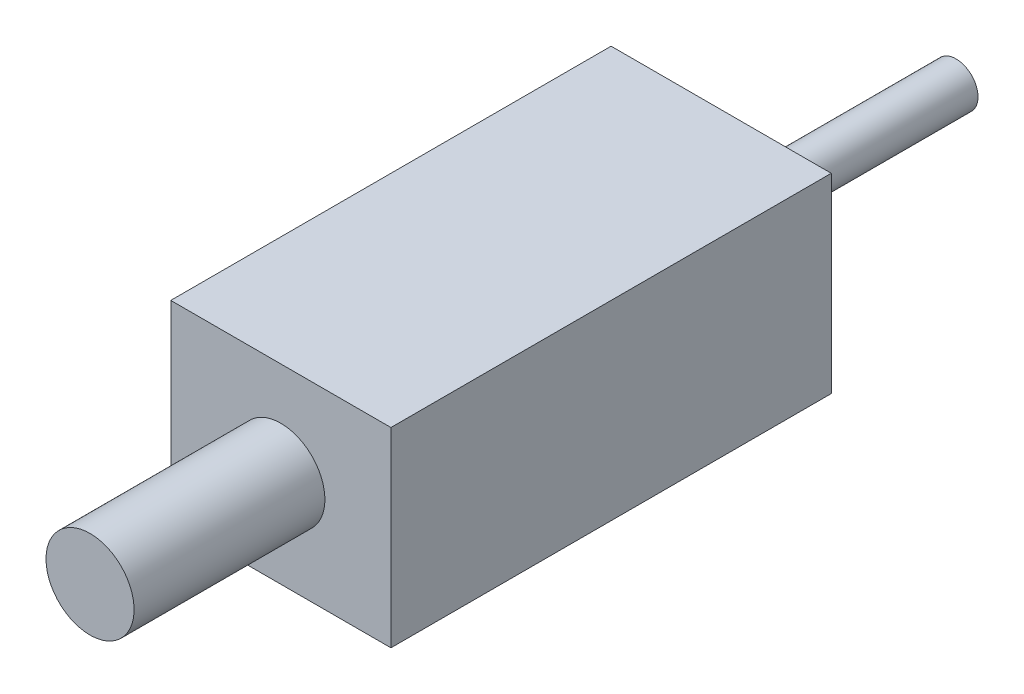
ISO-10303-21;
HEADER;
FILE_DESCRIPTION(('STEP AP214'),'2;1');
FILE_NAME('part.step','',(''),(''),'','','');
FILE_SCHEMA(('AUTOMOTIVE_DESIGN { 1 0 10303 214 1 1 1 1 }'));
ENDSEC;
DATA;
#1=APPLICATION_CONTEXT('core data for automotive mechanical design processes');
#2=APPLICATION_PROTOCOL_DEFINITION('international standard','automotive_design',2000,#1);
#3=PRODUCT_CONTEXT('',#1,'mechanical');
#4=PRODUCT('Part','Part','',(#3));
#5=PRODUCT_RELATED_PRODUCT_CATEGORY('part','',(#4));
#6=PRODUCT_DEFINITION_FORMATION('','',#4);
#7=PRODUCT_DEFINITION_CONTEXT('part definition',#1,'design');
#8=PRODUCT_DEFINITION('design','',#6,#7);
#9=PRODUCT_DEFINITION_SHAPE('','',#8);
#10=(LENGTH_UNIT() NAMED_UNIT(*) SI_UNIT(.MILLI.,.METRE.));
#11=(NAMED_UNIT(*) PLANE_ANGLE_UNIT() SI_UNIT($,.RADIAN.));
#12=(NAMED_UNIT(*) SI_UNIT($,.STERADIAN.) SOLID_ANGLE_UNIT());
#13=UNCERTAINTY_MEASURE_WITH_UNIT(LENGTH_MEASURE(1.E-05),#10,'distance_accuracy_value','');
#14=(GEOMETRIC_REPRESENTATION_CONTEXT(3) GLOBAL_UNCERTAINTY_ASSIGNED_CONTEXT((#13)) GLOBAL_UNIT_ASSIGNED_CONTEXT((#10,
#11,#12)) REPRESENTATION_CONTEXT('',''));
#15=CARTESIAN_POINT('',(0.,0.,0.));
#16=DIRECTION('',(0.,0.,1.));
#17=DIRECTION('',(1.,0.,0.));
#18=AXIS2_PLACEMENT_3D('',#15,#16,#17);
#19=CARTESIAN_POINT('',(7.5,6.5,30.));
#20=DIRECTION('',(-1.,0.,0.));
#21=DIRECTION('',(0.,-1.,0.));
#22=AXIS2_PLACEMENT_3D('',#19,#20,#21);
#23=PLANE('',#22);
#24=DIRECTION('',(0.,1.,0.));
#25=VECTOR('',#24,1.);
#26=CARTESIAN_POINT('',(7.5,6.5,0.));
#27=LINE('',#26,#25);
#28=CARTESIAN_POINT('',(7.5,-6.5,0.));
#29=VERTEX_POINT('',#28);
#30=CARTESIAN_POINT('',(7.5,6.5,0.));
#31=VERTEX_POINT('',#30);
#32=EDGE_CURVE('E108',#29,#31,#27,.T.);
#33=ORIENTED_EDGE('',*,*,#32,.T.);
#34=DIRECTION('',(0.,0.,-1.));
#35=VECTOR('',#34,1.);
#36=CARTESIAN_POINT('',(7.5,6.5,30.));
#37=LINE('',#36,#35);
#38=CARTESIAN_POINT('',(7.5,6.5,30.));
#39=VERTEX_POINT('',#38);
#40=EDGE_CURVE('E44',#39,#31,#37,.T.);
#41=ORIENTED_EDGE('',*,*,#40,.F.);
#42=DIRECTION('',(0.,1.,0.));
#43=VECTOR('',#42,1.);
#44=CARTESIAN_POINT('',(7.5,6.5,30.));
#45=LINE('',#44,#43);
#46=CARTESIAN_POINT('',(7.5,-6.5,30.));
#47=VERTEX_POINT('',#46);
#48=EDGE_CURVE('E95',#47,#39,#45,.T.);
#49=ORIENTED_EDGE('',*,*,#48,.F.);
#50=DIRECTION('',(0.,0.,-1.));
#51=VECTOR('',#50,1.);
#52=CARTESIAN_POINT('',(7.5,-6.5,30.));
#53=LINE('',#52,#51);
#54=EDGE_CURVE('E104',#47,#29,#53,.T.);
#55=ORIENTED_EDGE('',*,*,#54,.T.);
#56=EDGE_LOOP('',(#33,#41,#49,#55));
#57=FACE_BOUND('',#56,.T.);
#58=ADVANCED_FACE('F41',(#57),#23,.F.);
#59=CARTESIAN_POINT('',(-7.5,6.5,30.));
#60=DIRECTION('',(0.,-1.,0.));
#61=DIRECTION('',(0.,0.,-1.));
#62=AXIS2_PLACEMENT_3D('',#59,#60,#61);
#63=PLANE('',#62);
#64=DIRECTION('',(-1.,0.,0.));
#65=VECTOR('',#64,1.);
#66=CARTESIAN_POINT('',(-7.5,6.5,0.));
#67=LINE('',#66,#65);
#68=CARTESIAN_POINT('',(-7.5,6.5,0.));
#69=VERTEX_POINT('',#68);
#70=EDGE_CURVE('E100',#31,#69,#67,.T.);
#71=ORIENTED_EDGE('',*,*,#70,.T.);
#72=DIRECTION('',(0.,0.,-1.));
#73=VECTOR('',#72,1.);
#74=CARTESIAN_POINT('',(-7.5,6.5,30.));
#75=LINE('',#74,#73);
#76=CARTESIAN_POINT('',(-7.5,6.5,30.));
#77=VERTEX_POINT('',#76);
#78=EDGE_CURVE('E98',#77,#69,#75,.T.);
#79=ORIENTED_EDGE('',*,*,#78,.F.);
#80=DIRECTION('',(-1.,0.,0.));
#81=VECTOR('',#80,1.);
#82=CARTESIAN_POINT('',(-7.5,6.5,30.));
#83=LINE('',#82,#81);
#84=EDGE_CURVE('E90',#39,#77,#83,.T.);
#85=ORIENTED_EDGE('',*,*,#84,.F.);
#86=ORIENTED_EDGE('',*,*,#40,.T.);
#87=EDGE_LOOP('',(#71,#79,#85,#86));
#88=FACE_BOUND('',#87,.T.);
#89=ADVANCED_FACE('F99',(#88),#63,.F.);
#90=CARTESIAN_POINT('',(-7.5,6.5,30.));
#91=DIRECTION('',(1.,0.,0.));
#92=DIRECTION('',(0.,1.,0.));
#93=AXIS2_PLACEMENT_3D('',#90,#91,#92);
#94=PLANE('',#93);
#95=DIRECTION('',(0.,-1.,0.));
#96=VECTOR('',#95,1.);
#97=CARTESIAN_POINT('',(-7.5,6.5,0.));
#98=LINE('',#97,#96);
#99=CARTESIAN_POINT('',(-7.5,-6.5,0.));
#100=VERTEX_POINT('',#99);
#101=EDGE_CURVE('E76',#69,#100,#98,.T.);
#102=ORIENTED_EDGE('',*,*,#101,.T.);
#103=DIRECTION('',(0.,0.,-1.));
#104=VECTOR('',#103,1.);
#105=CARTESIAN_POINT('',(-7.5,-6.5,30.));
#106=LINE('',#105,#104);
#107=CARTESIAN_POINT('',(-7.5,-6.5,30.));
#108=VERTEX_POINT('',#107);
#109=EDGE_CURVE('E101',#108,#100,#106,.T.);
#110=ORIENTED_EDGE('',*,*,#109,.F.);
#111=DIRECTION('',(0.,-1.,0.));
#112=VECTOR('',#111,1.);
#113=CARTESIAN_POINT('',(-7.5,6.5,30.));
#114=LINE('',#113,#112);
#115=EDGE_CURVE('E93',#77,#108,#114,.T.);
#116=ORIENTED_EDGE('',*,*,#115,.F.);
#117=ORIENTED_EDGE('',*,*,#78,.T.);
#118=EDGE_LOOP('',(#102,#110,#116,#117));
#119=FACE_BOUND('',#118,.T.);
#120=ADVANCED_FACE('F102',(#119),#94,.F.);
#121=CARTESIAN_POINT('',(-7.5,-6.5,30.));
#122=DIRECTION('',(0.,1.,0.));
#123=DIRECTION('',(0.,0.,1.));
#124=AXIS2_PLACEMENT_3D('',#121,#122,#123);
#125=PLANE('',#124);
#126=DIRECTION('',(1.,0.,0.));
#127=VECTOR('',#126,1.);
#128=CARTESIAN_POINT('',(-7.5,-6.5,0.));
#129=LINE('',#128,#127);
#130=EDGE_CURVE('E82',#100,#29,#129,.T.);
#131=ORIENTED_EDGE('',*,*,#130,.T.);
#132=ORIENTED_EDGE('',*,*,#54,.F.);
#133=DIRECTION('',(1.,0.,0.));
#134=VECTOR('',#133,1.);
#135=CARTESIAN_POINT('',(-7.5,-6.5,30.));
#136=LINE('',#135,#134);
#137=EDGE_CURVE('E59',#108,#47,#136,.T.);
#138=ORIENTED_EDGE('',*,*,#137,.F.);
#139=ORIENTED_EDGE('',*,*,#109,.T.);
#140=EDGE_LOOP('',(#131,#132,#138,#139));
#141=FACE_BOUND('',#140,.T.);
#142=ADVANCED_FACE('F116',(#141),#125,.F.);
#143=CARTESIAN_POINT('',(0.,0.,30.));
#144=DIRECTION('',(0.,0.,1.));
#145=DIRECTION('',(1.,0.,0.));
#146=AXIS2_PLACEMENT_3D('',#143,#144,#145);
#147=PLANE('',#146);
#148=CARTESIAN_POINT('',(0.,0.,30.));
#149=DIRECTION('',(0.,0.,1.));
#150=DIRECTION('',(1.,0.,0.));
#151=AXIS2_PLACEMENT_3D('',#148,#149,#150);
#152=CIRCLE('',#151,3.);
#153=CARTESIAN_POINT('',(-3.,0.,30.));
#154=VERTEX_POINT('',#153);
#155=EDGE_CURVE('E11',#154,#154,#152,.T.);
#156=ORIENTED_EDGE('',*,*,#155,.F.);
#157=EDGE_LOOP('',(#156));
#158=FACE_BOUND('',#157,.T.);
#159=ORIENTED_EDGE('',*,*,#48,.T.);
#160=ORIENTED_EDGE('',*,*,#84,.T.);
#161=ORIENTED_EDGE('',*,*,#115,.T.);
#162=ORIENTED_EDGE('',*,*,#137,.T.);
#163=EDGE_LOOP('',(#159,#160,#161,#162));
#164=FACE_BOUND('',#163,.T.);
#165=ADVANCED_FACE('F91',(#158,#164),#147,.T.);
#166=CARTESIAN_POINT('',(0.,0.,0.));
#167=DIRECTION('',(0.,0.,1.));
#168=DIRECTION('',(1.,0.,0.));
#169=AXIS2_PLACEMENT_3D('',#166,#167,#168);
#170=PLANE('',#169);
#171=CARTESIAN_POINT('',(0.,0.,0.));
#172=DIRECTION('',(0.,0.,-1.));
#173=DIRECTION('',(-1.,0.,0.));
#174=AXIS2_PLACEMENT_3D('',#171,#172,#173);
#175=CIRCLE('',#174,1.5);
#176=CARTESIAN_POINT('',(-1.5,0.,0.));
#177=VERTEX_POINT('',#176);
#178=EDGE_CURVE('E50',#177,#177,#175,.T.);
#179=ORIENTED_EDGE('',*,*,#178,.F.);
#180=EDGE_LOOP('',(#179));
#181=FACE_BOUND('',#180,.T.);
#182=ORIENTED_EDGE('',*,*,#32,.F.);
#183=ORIENTED_EDGE('',*,*,#130,.F.);
#184=ORIENTED_EDGE('',*,*,#101,.F.);
#185=ORIENTED_EDGE('',*,*,#70,.F.);
#186=EDGE_LOOP('',(#182,#183,#184,#185));
#187=FACE_BOUND('',#186,.T.);
#188=ADVANCED_FACE('F119',(#181,#187),#170,.F.);
#189=CARTESIAN_POINT('',(0.,0.,-16.));
#190=DIRECTION('',(0.,0.,1.));
#191=DIRECTION('',(1.,0.,0.));
#192=AXIS2_PLACEMENT_3D('',#189,#190,#191);
#193=CYLINDRICAL_SURFACE('',#192,1.5);
#194=CARTESIAN_POINT('',(0.,0.,-16.));
#195=DIRECTION('',(0.,0.,-1.));
#196=DIRECTION('',(-1.,0.,0.));
#197=AXIS2_PLACEMENT_3D('',#194,#195,#196);
#198=CIRCLE('',#197,1.5);
#199=CARTESIAN_POINT('',(-1.5,0.,-16.));
#200=VERTEX_POINT('',#199);
#201=EDGE_CURVE('E111',#200,#200,#198,.T.);
#202=ORIENTED_EDGE('',*,*,#201,.F.);
#203=EDGE_LOOP('',(#202));
#204=FACE_BOUND('',#203,.T.);
#205=ORIENTED_EDGE('',*,*,#178,.T.);
#206=EDGE_LOOP('',(#205));
#207=FACE_BOUND('',#206,.T.);
#208=ADVANCED_FACE('F145',(#204,#207),#193,.T.);
#209=CARTESIAN_POINT('',(0.,0.,-16.));
#210=DIRECTION('',(0.,0.,-1.));
#211=DIRECTION('',(-1.,0.,0.));
#212=AXIS2_PLACEMENT_3D('',#209,#210,#211);
#213=PLANE('',#212);
#214=ORIENTED_EDGE('',*,*,#201,.T.);
#215=EDGE_LOOP('',(#214));
#216=FACE_BOUND('',#215,.T.);
#217=ADVANCED_FACE('F135',(#216),#213,.T.);
#218=CARTESIAN_POINT('',(0.,0.,43.));
#219=DIRECTION('',(0.,0.,-1.));
#220=DIRECTION('',(-1.,0.,0.));
#221=AXIS2_PLACEMENT_3D('',#218,#219,#220);
#222=CYLINDRICAL_SURFACE('',#221,3.);
#223=CARTESIAN_POINT('',(0.,0.,43.));
#224=DIRECTION('',(0.,0.,1.));
#225=DIRECTION('',(1.,0.,0.));
#226=AXIS2_PLACEMENT_3D('',#223,#224,#225);
#227=CIRCLE('',#226,3.);
#228=CARTESIAN_POINT('',(-3.,0.,43.));
#229=VERTEX_POINT('',#228);
#230=EDGE_CURVE('E125',#229,#229,#227,.T.);
#231=CARTESIAN_POINT('',(-3.,0.,43.));
#232=CARTESIAN_POINT('',(-3.,0.,42.8645833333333));
#233=CARTESIAN_POINT('',(-3.,0.,42.7291666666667));
#234=CARTESIAN_POINT('',(-3.,0.,42.4583333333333));
#235=CARTESIAN_POINT('',(-3.,0.,42.3229166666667));
#236=CARTESIAN_POINT('',(-3.,0.,42.0520833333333));
#237=CARTESIAN_POINT('',(-3.,0.,41.9166666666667));
#238=CARTESIAN_POINT('',(-3.,0.,41.6458333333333));
#239=CARTESIAN_POINT('',(-3.,0.,41.5104166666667));
#240=CARTESIAN_POINT('',(-3.,0.,41.2395833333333));
#241=CARTESIAN_POINT('',(-3.,0.,41.1041666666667));
#242=CARTESIAN_POINT('',(-3.,0.,40.8333333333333));
#243=CARTESIAN_POINT('',(-3.,0.,40.6979166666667));
#244=CARTESIAN_POINT('',(-3.,0.,40.4270833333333));
#245=CARTESIAN_POINT('',(-3.,0.,40.2916666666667));
#246=CARTESIAN_POINT('',(-3.,0.,40.0208333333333));
#247=CARTESIAN_POINT('',(-3.,0.,39.8854166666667));
#248=CARTESIAN_POINT('',(-3.,0.,39.6145833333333));
#249=CARTESIAN_POINT('',(-3.,0.,39.4791666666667));
#250=CARTESIAN_POINT('',(-3.,0.,39.2083333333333));
#251=CARTESIAN_POINT('',(-3.,0.,39.0729166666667));
#252=CARTESIAN_POINT('',(-3.,0.,38.8020833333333));
#253=CARTESIAN_POINT('',(-3.,0.,38.6666666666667));
#254=CARTESIAN_POINT('',(-3.,0.,38.3958333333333));
#255=CARTESIAN_POINT('',(-3.,0.,38.2604166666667));
#256=CARTESIAN_POINT('',(-3.,0.,37.9895833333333));
#257=CARTESIAN_POINT('',(-3.,0.,37.8541666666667));
#258=CARTESIAN_POINT('',(-3.,0.,37.5833333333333));
#259=CARTESIAN_POINT('',(-3.,0.,37.4479166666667));
#260=CARTESIAN_POINT('',(-3.,0.,37.1770833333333));
#261=CARTESIAN_POINT('',(-3.,0.,37.0416666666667));
#262=CARTESIAN_POINT('',(-3.,0.,36.7708333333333));
#263=CARTESIAN_POINT('',(-3.,0.,36.6354166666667));
#264=CARTESIAN_POINT('',(-3.,0.,36.3645833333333));
#265=CARTESIAN_POINT('',(-3.,0.,36.2291666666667));
#266=CARTESIAN_POINT('',(-3.,0.,35.9583333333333));
#267=CARTESIAN_POINT('',(-3.,0.,35.8229166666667));
#268=CARTESIAN_POINT('',(-3.,0.,35.5520833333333));
#269=CARTESIAN_POINT('',(-3.,0.,35.4166666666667));
#270=CARTESIAN_POINT('',(-3.,0.,35.1458333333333));
#271=CARTESIAN_POINT('',(-3.,0.,35.0104166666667));
#272=CARTESIAN_POINT('',(-3.,0.,34.7395833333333));
#273=CARTESIAN_POINT('',(-3.,0.,34.6041666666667));
#274=CARTESIAN_POINT('',(-3.,0.,34.3333333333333));
#275=CARTESIAN_POINT('',(-3.,0.,34.1979166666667));
#276=CARTESIAN_POINT('',(-3.,0.,33.9270833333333));
#277=CARTESIAN_POINT('',(-3.,0.,33.7916666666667));
#278=CARTESIAN_POINT('',(-3.,0.,33.5208333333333));
#279=CARTESIAN_POINT('',(-3.,0.,33.3854166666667));
#280=CARTESIAN_POINT('',(-3.,0.,33.1145833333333));
#281=CARTESIAN_POINT('',(-3.,0.,32.9791666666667));
#282=CARTESIAN_POINT('',(-3.,0.,32.7083333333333));
#283=CARTESIAN_POINT('',(-3.,0.,32.5729166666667));
#284=CARTESIAN_POINT('',(-3.,0.,32.3020833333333));
#285=CARTESIAN_POINT('',(-3.,0.,32.1666666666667));
#286=CARTESIAN_POINT('',(-3.,0.,31.8958333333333));
#287=CARTESIAN_POINT('',(-3.,0.,31.7604166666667));
#288=CARTESIAN_POINT('',(-3.,0.,31.4895833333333));
#289=CARTESIAN_POINT('',(-3.,0.,31.3541666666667));
#290=CARTESIAN_POINT('',(-3.,0.,31.0833333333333));
#291=CARTESIAN_POINT('',(-3.,0.,30.9479166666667));
#292=CARTESIAN_POINT('',(-3.,0.,30.6770833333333));
#293=CARTESIAN_POINT('',(-3.,0.,30.5416666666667));
#294=CARTESIAN_POINT('',(-3.,0.,30.2708333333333));
#295=CARTESIAN_POINT('',(-3.,0.,30.1354166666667));
#296=CARTESIAN_POINT('',(-3.,0.,30.));
#297=B_SPLINE_CURVE_WITH_KNOTS('',3,(#231,#232,#233,#234,#235,#236,#237,#238,#239,#240,#241,
#242,#243,#244,#245,#246,#247,#248,#249,#250,#251,#252,#253,#254,#255,#256,#257,#258,#259,#260,
#261,#262,#263,#264,#265,#266,#267,#268,#269,#270,#271,#272,#273,#274,#275,#276,#277,#278,#279,
#280,#281,#282,#283,#284,#285,#286,#287,#288,#289,#290,#291,#292,#293,#294,#295,#296),
.UNSPECIFIED.,.F.,.F.,(4,2,2,2,2,2,2,2,2,2,2,2,2,2,2,2,2,2,2,2,2,2,2,2,2,2,2,2,2,2,2,2,4),(0.,
0.406250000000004,0.812500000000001,1.21875,1.625,2.03125000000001,2.4375,2.84375000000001,3.25,
3.65625,4.0625,4.46875,4.875,5.28125,5.6875,6.09375,6.5,6.90625,7.3125,7.71875,8.125,8.53125,
8.9375,9.34375,9.75,10.15625,10.5625,10.96875,11.375,11.78125,12.1875,12.59375,13.),.UNSPECIFIED.);
#298=EDGE_CURVE('BSEAM132',#229,#154,#297,.T.);
#299=ORIENTED_EDGE('',*,*,#230,.F.);
#300=ORIENTED_EDGE('',*,*,#155,.T.);
#301=ORIENTED_EDGE('',*,*,#298,.T.);
#302=ORIENTED_EDGE('',*,*,#298,.F.);
#303=EDGE_LOOP('',(#299,#301,#300,#302));
#304=FACE_BOUND('',#303,.T.);
#305=ADVANCED_FACE('F132',(#304),#222,.T.);
#306=CARTESIAN_POINT('',(0.,0.,43.));
#307=DIRECTION('',(0.,0.,1.));
#308=DIRECTION('',(1.,0.,0.));
#309=AXIS2_PLACEMENT_3D('',#306,#307,#308);
#310=PLANE('',#309);
#311=ORIENTED_EDGE('',*,*,#230,.T.);
#312=EDGE_LOOP('',(#311));
#313=FACE_BOUND('',#312,.T.);
#314=ADVANCED_FACE('F130',(#313),#310,.T.);
#315=CLOSED_SHELL('',(#58,#89,#120,#142,#165,#188,#208,#217,#305,#314));
#316=MANIFOLD_SOLID_BREP('B2',#315);
#317=ADVANCED_BREP_SHAPE_REPRESENTATION('',(#18,#316),#14);
#318=SHAPE_DEFINITION_REPRESENTATION(#9,#317);
ENDSEC;
END-ISO-10303-21;
